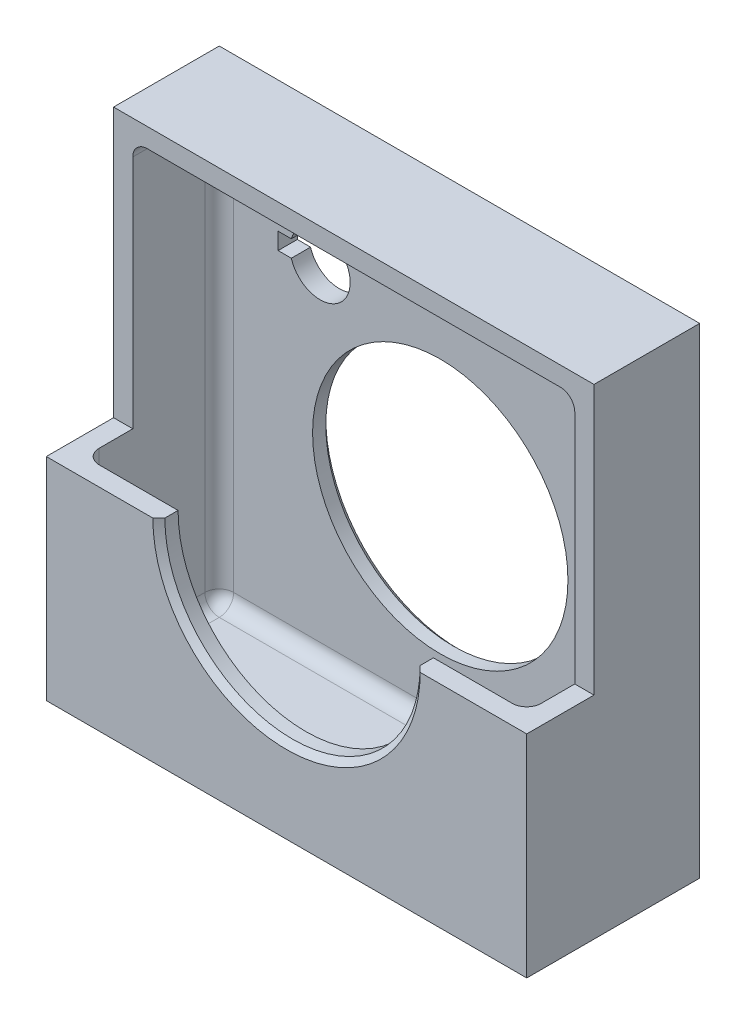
from build123d import *

# Parameters (mm, degrees)
SKETCH1_W          = 50.8
SKETCH1_H          = 50.8
MAIN_BODY_DEPTH    = 18.288
SKETCH2_W          = 7.112
SKETCH2_H          = 28.448
FRONT_CUT_DEPTH    = 75.133197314
SHELL1_T           = -2.032
SKETCH3_R          = 13.5001
CENTER_HOLE_DEPTH  = 75.133197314
FILL060_VERT_R     = 1.524
FILL060_TB_R       = 1.524
CHAM025_SIZE       = 0.635
KEYED_HOLE_1_DEPTH = 60.460200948


with BuildPart() as part:
    # Sketch1 → main body (new body)
    with BuildSketch(Plane.XY):
        with Locations((25.4, 25.4)):
            Rectangle(SKETCH1_W, SKETCH1_H)
    extrude(amount=MAIN_BODY_DEPTH)

    # Sketch2 → front cut (cut, through all)
    with BuildSketch(Plane(origin=(50.8, 0, 0), x_dir=(0, 0, -1), z_dir=(1, 0, 0))):
        with Locations((-14.732, 36.576)):
            Rectangle(SKETCH2_W, SKETCH2_H)
    extrude(amount=-FRONT_CUT_DEPTH, mode=Mode.SUBTRACT)

    # Shell1
    shell1_openings = [part.faces().sort_by_distance(p)[0] for p in [
        (25.4, 36.576, 11.176),
        (25.4, 22.352, 14.732),
    ]]
    offset(amount=SHELL1_T, openings=shell1_openings, kind=Kind.INTERSECTION)

    # Sketch3 → center hole (cut, through all)
    with BuildSketch(Plane.XY):
        with Locations((25.4, 22.352)):
            Circle(SKETCH3_R)
    extrude(amount=CENTER_HOLE_DEPTH, mode=Mode.SUBTRACT)

    # fill060.vert
    fill060_vert_edges = [part.edges().sort_by_distance(p)[0] for p in [
        (2.032, 12.192, 16.256),
        (48.768, 12.192, 16.256),
        (2.032, 25.4, 2.032),
        (48.768, 25.4, 2.032),
    ]]
    fillet(fill060_vert_edges, radius=FILL060_VERT_R)

    # fill060.tb
    fill060_tb_edges = [part.edges().sort_by_distance(p)[0] for p in [
        (2.032, 48.768, 7.366),
        (48.768, 48.768, 7.366),
        (25.4, 2.032, 16.256),
        (25.4, 2.032, 2.032),
        (2.032, 2.032, 9.144),
        (48.768, 2.032, 9.144),
        (2.478369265, 2.032, 15.809630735),
        (2.478369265, 2.032, 2.478369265),
        (48.321630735, 2.032, 2.478369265),
        (48.321630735, 2.032, 15.809630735),
        (25.4, 48.768, 2.032),
        (2.478369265, 48.768, 2.478369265),
        (48.321630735, 48.768, 2.478369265),
    ]]
    fillet(fill060_tb_edges, radius=FILL060_TB_R)

    # cham025
    cham025_edges = [part.edges().sort_by_distance(p)[0] for p in [
        (11.8999, 22.352, 0),
        (25.4, 8.8519, 18.288),
    ]]
    chamfer(cham025_edges, length=CHAM025_SIZE)

    # Sketch6 → Keyed Hole 1 (cut, through all)
    with BuildSketch(Plane(origin=(10.255789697, 39.461773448, 0), x_dir=(-1, 0, 0), z_dir=(0, 0, -1))):
        with BuildLine():
            Line((0.603789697, -0.472773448), (2.000789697, -0.472773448))
            Line((2.000789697, -0.472773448), (2.000789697, -2.250773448))
            Line((2.000789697, -2.250773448), (0.603789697, -2.250773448))
            ThreePointArc((0.603789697, -2.250773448), (-5.619210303, -1.361773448), (0.603789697, -0.472773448))
        make_face()
    extrude(amount=-KEYED_HOLE_1_DEPTH, mode=Mode.SUBTRACT)


solid = part.part
